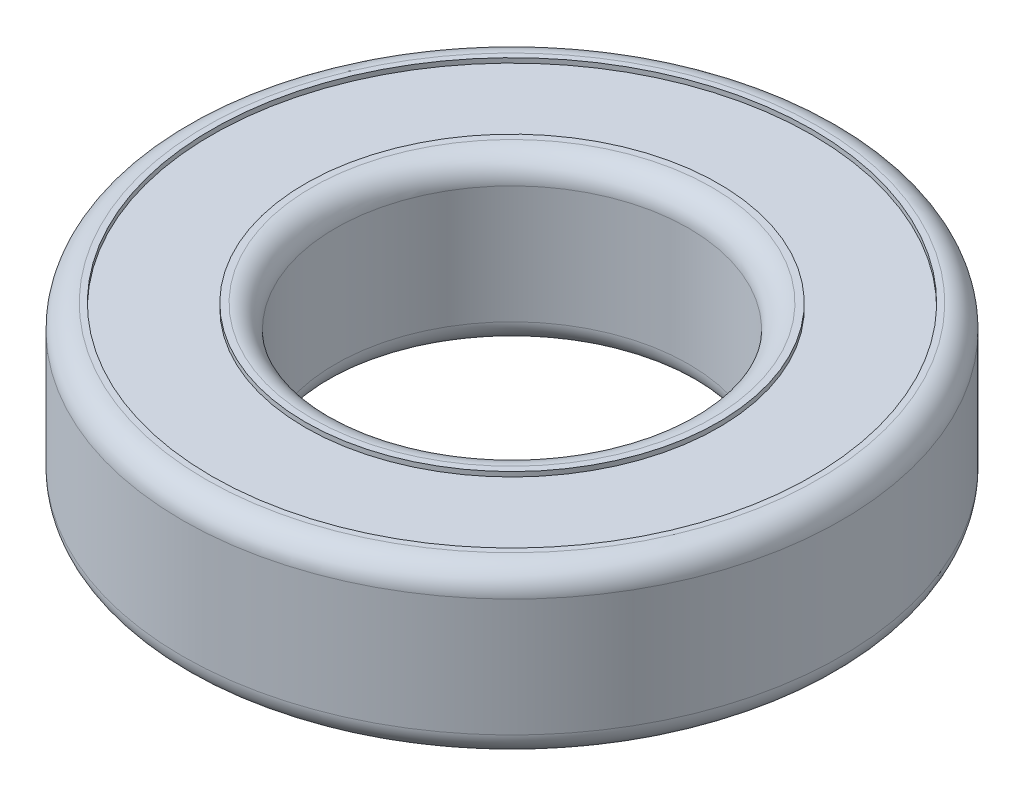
from build123d import *

# Parameters (mm, degrees)
SKETCH_2_R          = 12.756382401
SKETCH_2_R_2        = 8.778084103
CUT_EXTRUDE_1_DEPTH = 0.2


with BuildPart() as part:
    # Sketch 1 → Revolve 1 (revolve)
    with BuildSketch(Plane.XY, mode=Mode.PRIVATE) as revolve_1_sk:
        with BuildLine():
            Line((-13, 3.5), (-8.5, 3.5))
            ThreePointArc((-8.5, 3.5), (-7.792893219, 3.207106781), (-7.5, 2.5))
            Line((-7.5, 2.5), (-7.5, -2.5))
            ThreePointArc((-7.5, -2.5), (-7.792893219, -3.207106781), (-8.5, -3.5))
            Line((-8.5, -3.5), (-13, -3.5))
            ThreePointArc((-13, -3.5), (-13.707106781, -3.207106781), (-14, -2.5))
            Line((-14, -2.5), (-14, 2.5))
            ThreePointArc((-14, 2.5), (-13.707106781, 3.207106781), (-13, 3.5))
        make_face()
    revolve(revolve_1_sk.sketch.rotate(Axis((0, 0, 0), (0, 1, 0)), 270), axis=Axis((0, 0, 0), (0, 1, 0)))

    # Sketch 2 → Cut-Extrude 1 (cut)
    with BuildSketch(Plane(origin=(0, 3.5, 0), x_dir=(1, 0, 0), z_dir=(0, 1, 0))):
        with Locations(Location((0, 0, 0), (0, 0, 270))):
            Circle(SKETCH_2_R)
        with Locations(Location((0, 0, 0), (0, 0, 270))):
            Circle(SKETCH_2_R_2, mode=Mode.SUBTRACT)
    cut_extrude_1 = extrude(amount=-CUT_EXTRUDE_1_DEPTH, mode=Mode.SUBTRACT)

    # Mirror 1: Cut-Extrude 1 across plane
    add(cut_extrude_1.mirror(Plane.ZX), mode=Mode.SUBTRACT)


solid = part.part
